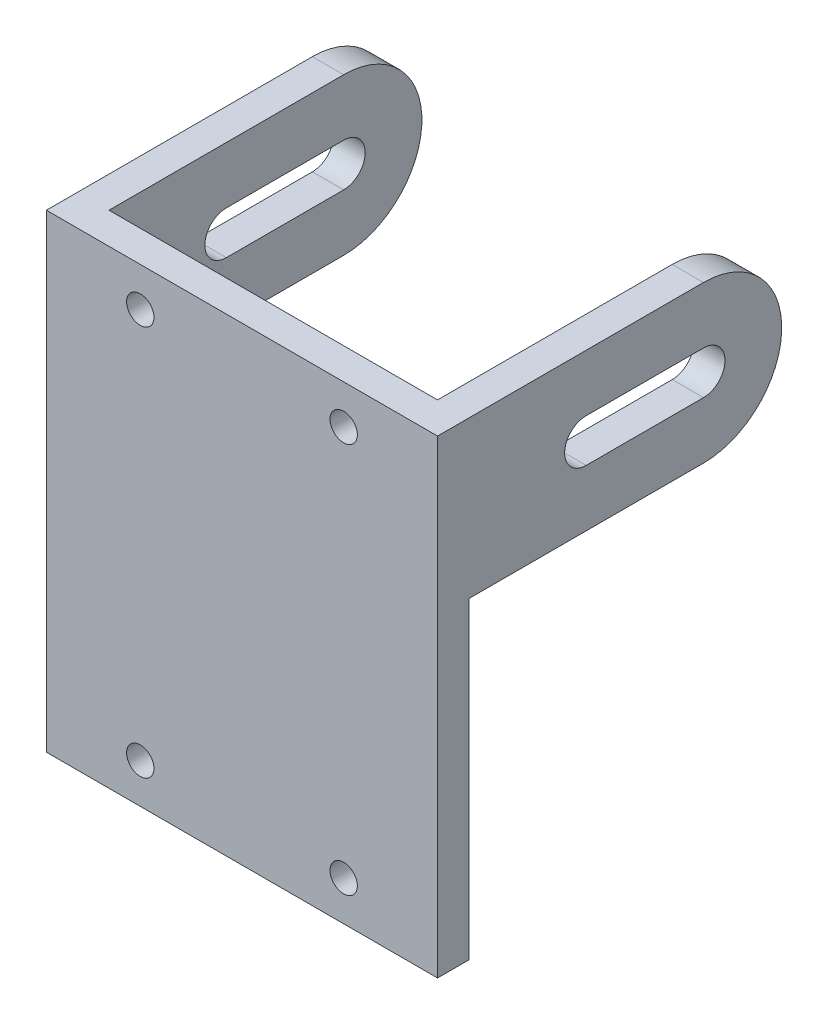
from build123d import *

# Parameters (mm, degrees)
SKIZZE1_W                       = 50
SKIZZE1_H                       = 60
SKIZZE1_R                       = 1.75
AUFSATZ_LINEAR_AUSTRAGEN1_DEPTH = 4
AUFSATZ_LINEAR_AUSTRAGEN3_DEPTH = 4
AUFSATZ_LINEAR_START            = -4
AUFSATZ_LINEAR_AUSTRAGEN4_DEPTH = 4


with BuildPart() as part:
    # Skizze1 → Aufsatz-Linear austragen1 (new body)
    with BuildSketch(Plane.XY):
        with Locations((25, -30)):
            Rectangle(SKIZZE1_W, SKIZZE1_H)
        with Locations((12, -5)):
            Circle(SKIZZE1_R, mode=Mode.SUBTRACT)
        with Locations((12, -54.937460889)):
            Circle(SKIZZE1_R, mode=Mode.SUBTRACT)
        with Locations(Location((38, -54.937460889, 0), (0, 0, 180))):
            Circle(SKIZZE1_R, mode=Mode.SUBTRACT)
        with Locations(Location((38, -5, 0), (0, 0, 180))):
            Circle(SKIZZE1_R, mode=Mode.SUBTRACT)
    extrude(amount=AUFSATZ_LINEAR_AUSTRAGEN1_DEPTH)

    # Skizze4 → Aufsatz-Linear austragen3 (add)
    with BuildSketch(Plane.ZY):
        with BuildLine():
            Line((0, 0), (-30, 0))
            ThreePointArc((-30, 0), (-40, -10), (-30, -20))
            Line((-30, -20), (0, -20))
            Line((0, -20), (0, 0))
        make_face()
        with BuildLine():
            Line((-30, -7.25), (-15, -7.25))
            ThreePointArc((-15, -7.25), (-12.25, -10), (-15, -12.75))
            Line((-15, -12.75), (-30, -12.75))
            ThreePointArc((-30, -12.75), (-32.75, -10), (-30, -7.25))
        make_face(mode=Mode.SUBTRACT)
    extrude(amount=-AUFSATZ_LINEAR_AUSTRAGEN3_DEPTH)

    # Skizze5 → Aufsatz-Linear austragen4 (add)
    with BuildSketch(Plane(origin=(50, 0, 0), x_dir=(0, 0, -1), z_dir=(1, 0, 0)).offset(AUFSATZ_LINEAR_START)):
        with BuildLine():
            Line((0, 0), (0, -20))
            Line((0, -20), (30, -20))
            ThreePointArc((30, -20), (40, -10), (30, 0))
            Line((30, 0), (0, 0))
        make_face()
        with BuildLine():
            Line((30, -12.75), (15, -12.75))
            ThreePointArc((15, -12.75), (12.25, -10), (15, -7.25))
            Line((15, -7.25), (30, -7.25))
            ThreePointArc((30, -7.25), (32.75, -10), (30, -12.75))
        make_face(mode=Mode.SUBTRACT)
    extrude(amount=AUFSATZ_LINEAR_AUSTRAGEN4_DEPTH)


solid = part.part
